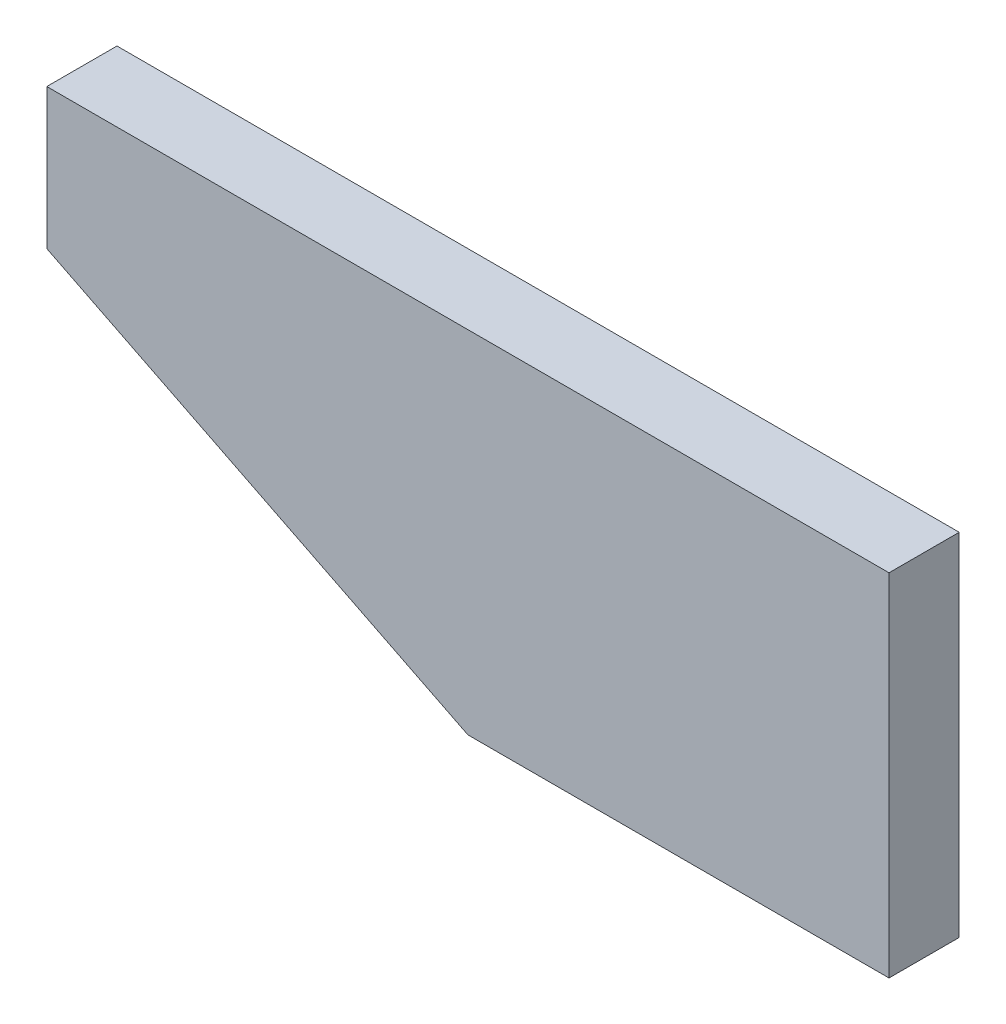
ISO-10303-21;
HEADER;
FILE_DESCRIPTION(('STEP AP214'),'2;1');
FILE_NAME('part.step','',(''),(''),'','','');
FILE_SCHEMA(('AUTOMOTIVE_DESIGN { 1 0 10303 214 1 1 1 1 }'));
ENDSEC;
DATA;
#1=APPLICATION_CONTEXT('core data for automotive mechanical design processes');
#2=APPLICATION_PROTOCOL_DEFINITION('international standard','automotive_design',2000,#1);
#3=PRODUCT_CONTEXT('',#1,'mechanical');
#4=PRODUCT('Part','Part','',(#3));
#5=PRODUCT_RELATED_PRODUCT_CATEGORY('part','',(#4));
#6=PRODUCT_DEFINITION_FORMATION('','',#4);
#7=PRODUCT_DEFINITION_CONTEXT('part definition',#1,'design');
#8=PRODUCT_DEFINITION('design','',#6,#7);
#9=PRODUCT_DEFINITION_SHAPE('','',#8);
#10=(LENGTH_UNIT() NAMED_UNIT(*) SI_UNIT(.MILLI.,.METRE.));
#11=(NAMED_UNIT(*) PLANE_ANGLE_UNIT() SI_UNIT($,.RADIAN.));
#12=(NAMED_UNIT(*) SI_UNIT($,.STERADIAN.) SOLID_ANGLE_UNIT());
#13=UNCERTAINTY_MEASURE_WITH_UNIT(LENGTH_MEASURE(1.E-05),#10,'distance_accuracy_value','');
#14=(GEOMETRIC_REPRESENTATION_CONTEXT(3) GLOBAL_UNCERTAINTY_ASSIGNED_CONTEXT((#13)) GLOBAL_UNIT_ASSIGNED_CONTEXT((#10,
#11,#12)) REPRESENTATION_CONTEXT('',''));
#15=CARTESIAN_POINT('',(0.,0.,0.));
#16=DIRECTION('',(0.,0.,1.));
#17=DIRECTION('',(1.,0.,0.));
#18=AXIS2_PLACEMENT_3D('',#15,#16,#17);
#19=CARTESIAN_POINT('',(33.2095494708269,18.8328916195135,0.));
#20=DIRECTION('',(0.,0.,1.));
#21=DIRECTION('',(1.,0.,0.));
#22=AXIS2_PLACEMENT_3D('',#19,#20,#21);
#23=PLANE('',#22);
#24=DIRECTION('',(0.,1.,0.));
#25=VECTOR('',#24,1.);
#26=CARTESIAN_POINT('',(-26.7904505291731,-6.16710838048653,0.));
#27=LINE('',#26,#25);
#28=CARTESIAN_POINT('',(-26.7904505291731,43.8328916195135,0.));
#29=VERTEX_POINT('',#28);
#30=CARTESIAN_POINT('',(-26.7904505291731,23.8328916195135,0.));
#31=VERTEX_POINT('',#30);
#32=EDGE_CURVE('E94',#29,#31,#27,.F.);
#33=ORIENTED_EDGE('',*,*,#32,.F.);
#34=DIRECTION('',(1.,0.,0.));
#35=VECTOR('',#34,1.);
#36=CARTESIAN_POINT('',(-26.7904505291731,43.8328916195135,0.));
#37=LINE('',#36,#35);
#38=CARTESIAN_POINT('',(93.2095494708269,43.8328916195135,0.));
#39=VERTEX_POINT('',#38);
#40=EDGE_CURVE('E55',#39,#29,#37,.F.);
#41=ORIENTED_EDGE('',*,*,#40,.F.);
#42=DIRECTION('',(0.,1.,0.));
#43=VECTOR('',#42,1.);
#44=CARTESIAN_POINT('',(93.2095494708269,43.8328916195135,0.));
#45=LINE('',#44,#43);
#46=CARTESIAN_POINT('',(93.2095494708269,-6.16710838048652,0.));
#47=VERTEX_POINT('',#46);
#48=EDGE_CURVE('E79',#47,#39,#45,.T.);
#49=ORIENTED_EDGE('',*,*,#48,.F.);
#50=DIRECTION('',(1.,0.,0.));
#51=VECTOR('',#50,1.);
#52=CARTESIAN_POINT('',(93.2095494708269,-6.16710838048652,0.));
#53=LINE('',#52,#51);
#54=CARTESIAN_POINT('',(33.2095494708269,-6.16710838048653,0.));
#55=VERTEX_POINT('',#54);
#56=EDGE_CURVE('E78',#55,#47,#53,.T.);
#57=ORIENTED_EDGE('',*,*,#56,.F.);
#58=DIRECTION('',(0.894427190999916,-0.447213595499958,0.));
#59=VECTOR('',#58,1.);
#60=CARTESIAN_POINT('',(3.20954947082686,8.83289161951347,0.));
#61=LINE('',#60,#59);
#62=EDGE_CURVE('E67',#31,#55,#61,.T.);
#63=ORIENTED_EDGE('',*,*,#62,.F.);
#64=EDGE_LOOP('',(#33,#41,#49,#57,#63));
#65=FACE_BOUND('',#64,.T.);
#66=ADVANCED_FACE('F16',(#65),#23,.F.);
#67=CARTESIAN_POINT('',(3.20954947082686,8.83289161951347,0.));
#68=DIRECTION('',(-0.447213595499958,-0.894427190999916,0.));
#69=DIRECTION('',(0.894427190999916,-0.447213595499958,0.));
#70=AXIS2_PLACEMENT_3D('',#67,#68,#69);
#71=PLANE('',#70);
#72=ORIENTED_EDGE('',*,*,#62,.T.);
#73=DIRECTION('',(0.,0.,-1.));
#74=VECTOR('',#73,1.);
#75=CARTESIAN_POINT('',(33.2095494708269,-6.16710838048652,0.));
#76=LINE('',#75,#74);
#77=CARTESIAN_POINT('',(33.2095494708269,-6.16710838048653,10.));
#78=VERTEX_POINT('',#77);
#79=EDGE_CURVE('E71',#78,#55,#76,.T.);
#80=ORIENTED_EDGE('',*,*,#79,.F.);
#81=DIRECTION('',(0.894427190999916,-0.447213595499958,0.));
#82=VECTOR('',#81,1.);
#83=CARTESIAN_POINT('',(-26.7904505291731,23.8328916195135,10.));
#84=LINE('',#83,#82);
#85=CARTESIAN_POINT('',(-26.7904505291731,23.8328916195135,10.));
#86=VERTEX_POINT('',#85);
#87=EDGE_CURVE('E20',#86,#78,#84,.T.);
#88=ORIENTED_EDGE('',*,*,#87,.F.);
#89=DIRECTION('',(0.,0.,1.));
#90=VECTOR('',#89,1.);
#91=CARTESIAN_POINT('',(-26.7904505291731,23.8328916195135,0.));
#92=LINE('',#91,#90);
#93=EDGE_CURVE('E73',#31,#86,#92,.T.);
#94=ORIENTED_EDGE('',*,*,#93,.F.);
#95=EDGE_LOOP('',(#72,#80,#88,#94));
#96=FACE_BOUND('',#95,.T.);
#97=ADVANCED_FACE('F69',(#96),#71,.T.);
#98=CARTESIAN_POINT('',(93.2095494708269,-6.16710838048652,0.));
#99=DIRECTION('',(0.,-1.,0.));
#100=DIRECTION('',(0.,0.,-1.));
#101=AXIS2_PLACEMENT_3D('',#98,#99,#100);
#102=PLANE('',#101);
#103=DIRECTION('',(0.,0.,-1.));
#104=VECTOR('',#103,1.);
#105=CARTESIAN_POINT('',(93.2095494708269,-6.16710838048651,0.));
#106=LINE('',#105,#104);
#107=CARTESIAN_POINT('',(93.2095494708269,-6.16710838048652,10.));
#108=VERTEX_POINT('',#107);
#109=EDGE_CURVE('E82',#108,#47,#106,.T.);
#110=ORIENTED_EDGE('',*,*,#109,.F.);
#111=DIRECTION('',(1.,0.,0.));
#112=VECTOR('',#111,1.);
#113=CARTESIAN_POINT('',(33.2095494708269,-6.16710838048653,10.));
#114=LINE('',#113,#112);
#115=EDGE_CURVE('E86',#78,#108,#114,.T.);
#116=ORIENTED_EDGE('',*,*,#115,.F.);
#117=ORIENTED_EDGE('',*,*,#79,.T.);
#118=ORIENTED_EDGE('',*,*,#56,.T.);
#119=EDGE_LOOP('',(#110,#116,#117,#118));
#120=FACE_BOUND('',#119,.T.);
#121=ADVANCED_FACE('F84',(#120),#102,.T.);
#122=CARTESIAN_POINT('',(93.2095494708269,43.8328916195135,0.));
#123=DIRECTION('',(1.,0.,0.));
#124=DIRECTION('',(0.,0.,-1.));
#125=AXIS2_PLACEMENT_3D('',#122,#123,#124);
#126=PLANE('',#125);
#127=ORIENTED_EDGE('',*,*,#48,.T.);
#128=DIRECTION('',(0.,0.,1.));
#129=VECTOR('',#128,1.);
#130=CARTESIAN_POINT('',(93.2095494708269,43.8328916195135,0.));
#131=LINE('',#130,#129);
#132=CARTESIAN_POINT('',(93.2095494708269,43.8328916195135,10.));
#133=VERTEX_POINT('',#132);
#134=EDGE_CURVE('E90',#133,#39,#131,.F.);
#135=ORIENTED_EDGE('',*,*,#134,.F.);
#136=DIRECTION('',(0.,1.,0.));
#137=VECTOR('',#136,1.);
#138=CARTESIAN_POINT('',(93.2095494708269,18.8328916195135,10.));
#139=LINE('',#138,#137);
#140=EDGE_CURVE('E100',#108,#133,#139,.T.);
#141=ORIENTED_EDGE('',*,*,#140,.F.);
#142=ORIENTED_EDGE('',*,*,#109,.T.);
#143=EDGE_LOOP('',(#127,#135,#141,#142));
#144=FACE_BOUND('',#143,.T.);
#145=ADVANCED_FACE('F108',(#144),#126,.T.);
#146=CARTESIAN_POINT('',(-26.7904505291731,43.8328916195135,0.));
#147=DIRECTION('',(0.,1.,0.));
#148=DIRECTION('',(0.,0.,1.));
#149=AXIS2_PLACEMENT_3D('',#146,#147,#148);
#150=PLANE('',#149);
#151=ORIENTED_EDGE('',*,*,#40,.T.);
#152=DIRECTION('',(0.,0.,1.));
#153=VECTOR('',#152,1.);
#154=CARTESIAN_POINT('',(-26.7904505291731,43.8328916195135,0.));
#155=LINE('',#154,#153);
#156=CARTESIAN_POINT('',(-26.7904505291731,43.8328916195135,10.));
#157=VERTEX_POINT('',#156);
#158=EDGE_CURVE('E35',#157,#29,#155,.F.);
#159=ORIENTED_EDGE('',*,*,#158,.F.);
#160=DIRECTION('',(1.,0.,0.));
#161=VECTOR('',#160,1.);
#162=CARTESIAN_POINT('',(33.2095494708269,43.8328916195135,10.));
#163=LINE('',#162,#161);
#164=EDGE_CURVE('E26',#133,#157,#163,.F.);
#165=ORIENTED_EDGE('',*,*,#164,.F.);
#166=ORIENTED_EDGE('',*,*,#134,.T.);
#167=EDGE_LOOP('',(#151,#159,#165,#166));
#168=FACE_BOUND('',#167,.T.);
#169=ADVANCED_FACE('F105',(#168),#150,.T.);
#170=CARTESIAN_POINT('',(-26.7904505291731,-6.16710838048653,0.));
#171=DIRECTION('',(-1.,0.,0.));
#172=DIRECTION('',(0.,0.,1.));
#173=AXIS2_PLACEMENT_3D('',#170,#171,#172);
#174=PLANE('',#173);
#175=ORIENTED_EDGE('',*,*,#158,.T.);
#176=ORIENTED_EDGE('',*,*,#32,.T.);
#177=ORIENTED_EDGE('',*,*,#93,.T.);
#178=DIRECTION('',(0.,1.,0.));
#179=VECTOR('',#178,1.);
#180=CARTESIAN_POINT('',(-26.7904505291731,18.8328916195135,10.));
#181=LINE('',#180,#179);
#182=EDGE_CURVE('E10',#157,#86,#181,.F.);
#183=ORIENTED_EDGE('',*,*,#182,.F.);
#184=EDGE_LOOP('',(#175,#176,#177,#183));
#185=FACE_BOUND('',#184,.T.);
#186=ADVANCED_FACE('F104',(#185),#174,.T.);
#187=CARTESIAN_POINT('',(33.2095494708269,18.8328916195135,10.));
#188=DIRECTION('',(0.,0.,1.));
#189=DIRECTION('',(1.,0.,0.));
#190=AXIS2_PLACEMENT_3D('',#187,#188,#189);
#191=PLANE('',#190);
#192=ORIENTED_EDGE('',*,*,#164,.T.);
#193=ORIENTED_EDGE('',*,*,#182,.T.);
#194=ORIENTED_EDGE('',*,*,#87,.T.);
#195=ORIENTED_EDGE('',*,*,#115,.T.);
#196=ORIENTED_EDGE('',*,*,#140,.T.);
#197=EDGE_LOOP('',(#192,#193,#194,#195,#196));
#198=FACE_BOUND('',#197,.T.);
#199=ADVANCED_FACE('F18',(#198),#191,.T.);
#200=CLOSED_SHELL('',(#66,#97,#121,#145,#169,#186,#199));
#201=MANIFOLD_SOLID_BREP('B1',#200);
#202=ADVANCED_BREP_SHAPE_REPRESENTATION('',(#18,#201),#14);
#203=SHAPE_DEFINITION_REPRESENTATION(#9,#202);
ENDSEC;
END-ISO-10303-21;
